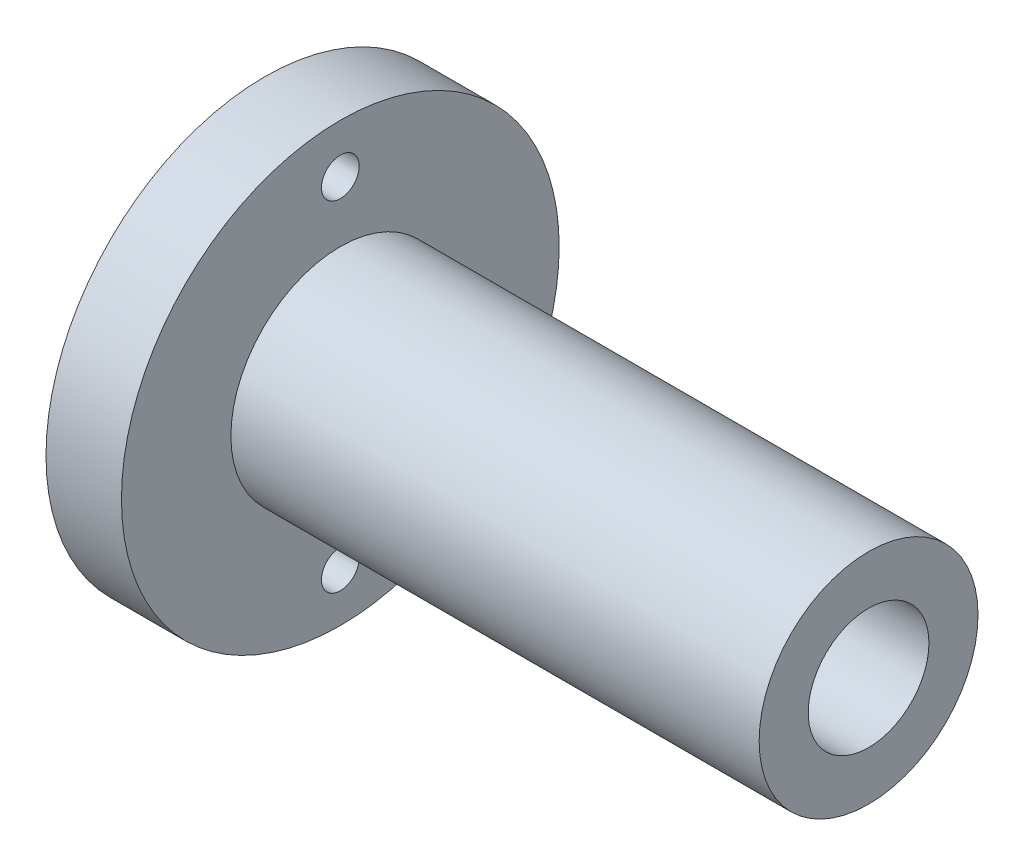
ISO-10303-21;
HEADER;
FILE_DESCRIPTION(('STEP AP214'),'2;1');
FILE_NAME('part.step','',(''),(''),'','','');
FILE_SCHEMA(('AUTOMOTIVE_DESIGN { 1 0 10303 214 1 1 1 1 }'));
ENDSEC;
DATA;
#1=APPLICATION_CONTEXT('core data for automotive mechanical design processes');
#2=APPLICATION_PROTOCOL_DEFINITION('international standard','automotive_design',2000,#1);
#3=PRODUCT_CONTEXT('',#1,'mechanical');
#4=PRODUCT('Part','Part','',(#3));
#5=PRODUCT_RELATED_PRODUCT_CATEGORY('part','',(#4));
#6=PRODUCT_DEFINITION_FORMATION('','',#4);
#7=PRODUCT_DEFINITION_CONTEXT('part definition',#1,'design');
#8=PRODUCT_DEFINITION('design','',#6,#7);
#9=PRODUCT_DEFINITION_SHAPE('','',#8);
#10=(LENGTH_UNIT() NAMED_UNIT(*) SI_UNIT(.MILLI.,.METRE.));
#11=(NAMED_UNIT(*) PLANE_ANGLE_UNIT() SI_UNIT($,.RADIAN.));
#12=(NAMED_UNIT(*) SI_UNIT($,.STERADIAN.) SOLID_ANGLE_UNIT());
#13=UNCERTAINTY_MEASURE_WITH_UNIT(LENGTH_MEASURE(1.E-05),#10,'distance_accuracy_value','');
#14=(GEOMETRIC_REPRESENTATION_CONTEXT(3) GLOBAL_UNCERTAINTY_ASSIGNED_CONTEXT((#13)) GLOBAL_UNIT_ASSIGNED_CONTEXT((#10,
#11,#12)) REPRESENTATION_CONTEXT('',''));
#15=CARTESIAN_POINT('',(0.,0.,0.));
#16=DIRECTION('',(0.,0.,1.));
#17=DIRECTION('',(1.,0.,0.));
#18=AXIS2_PLACEMENT_3D('',#15,#16,#17);
#19=CARTESIAN_POINT('',(70.,0.,0.));
#20=DIRECTION('',(-1.,0.,0.));
#21=DIRECTION('',(0.,0.,1.));
#22=AXIS2_PLACEMENT_3D('',#19,#20,#21);
#23=CYLINDRICAL_SURFACE('',#22,14.5);
#24=CARTESIAN_POINT('',(70.,0.,0.));
#25=DIRECTION('',(1.,0.,0.));
#26=DIRECTION('',(0.,0.,-1.));
#27=AXIS2_PLACEMENT_3D('',#24,#25,#26);
#28=CIRCLE('',#27,14.5);
#29=CARTESIAN_POINT('',(70.,0.,-14.5));
#30=VERTEX_POINT('',#29);
#31=EDGE_CURVE('E63',#30,#30,#28,.T.);
#32=ORIENTED_EDGE('',*,*,#31,.F.);
#33=EDGE_LOOP('',(#32));
#34=FACE_BOUND('',#33,.T.);
#35=CARTESIAN_POINT('',(0.,0.,0.));
#36=DIRECTION('',(1.,0.,0.));
#37=DIRECTION('',(0.,0.,-1.));
#38=AXIS2_PLACEMENT_3D('',#35,#36,#37);
#39=CIRCLE('',#38,14.5);
#40=CARTESIAN_POINT('',(0.,0.,-14.5));
#41=VERTEX_POINT('',#40);
#42=EDGE_CURVE('E69',#41,#41,#39,.T.);
#43=ORIENTED_EDGE('',*,*,#42,.T.);
#44=EDGE_LOOP('',(#43));
#45=FACE_BOUND('',#44,.T.);
#46=ADVANCED_FACE('F49',(#34,#45),#23,.T.);
#47=CARTESIAN_POINT('',(70.,0.,0.));
#48=DIRECTION('',(1.,0.,0.));
#49=DIRECTION('',(0.,0.,-1.));
#50=AXIS2_PLACEMENT_3D('',#47,#48,#49);
#51=PLANE('',#50);
#52=CARTESIAN_POINT('',(70.,0.,0.));
#53=DIRECTION('',(1.,0.,0.));
#54=DIRECTION('',(0.,0.,-1.));
#55=AXIS2_PLACEMENT_3D('',#52,#53,#54);
#56=CIRCLE('',#55,8.);
#57=CARTESIAN_POINT('',(70.,0.,-8.));
#58=VERTEX_POINT('',#57);
#59=EDGE_CURVE('E87',#58,#58,#56,.T.);
#60=ORIENTED_EDGE('',*,*,#59,.F.);
#61=EDGE_LOOP('',(#60));
#62=FACE_BOUND('',#61,.T.);
#63=ORIENTED_EDGE('',*,*,#31,.T.);
#64=EDGE_LOOP('',(#63));
#65=FACE_BOUND('',#64,.T.);
#66=ADVANCED_FACE('F128',(#62,#65),#51,.T.);
#67=CARTESIAN_POINT('',(-10.,0.,0.));
#68=DIRECTION('',(1.,0.,0.));
#69=DIRECTION('',(0.,0.,-1.));
#70=AXIS2_PLACEMENT_3D('',#67,#68,#69);
#71=CYLINDRICAL_SURFACE('',#70,29.);
#72=CARTESIAN_POINT('',(-10.,0.,0.));
#73=DIRECTION('',(-1.,0.,0.));
#74=DIRECTION('',(0.,0.,1.));
#75=AXIS2_PLACEMENT_3D('',#72,#73,#74);
#76=CIRCLE('',#75,29.);
#77=CARTESIAN_POINT('',(-10.,0.,29.));
#78=VERTEX_POINT('',#77);
#79=EDGE_CURVE('E74',#78,#78,#76,.T.);
#80=ORIENTED_EDGE('',*,*,#79,.F.);
#81=EDGE_LOOP('',(#80));
#82=FACE_BOUND('',#81,.T.);
#83=CARTESIAN_POINT('',(0.,0.,0.));
#84=DIRECTION('',(-1.,0.,0.));
#85=DIRECTION('',(0.,0.,1.));
#86=AXIS2_PLACEMENT_3D('',#83,#84,#85);
#87=CIRCLE('',#86,29.);
#88=CARTESIAN_POINT('',(0.,0.,29.));
#89=VERTEX_POINT('',#88);
#90=EDGE_CURVE('E76',#89,#89,#87,.T.);
#91=ORIENTED_EDGE('',*,*,#90,.T.);
#92=EDGE_LOOP('',(#91));
#93=FACE_BOUND('',#92,.T.);
#94=ADVANCED_FACE('F120',(#82,#93),#71,.T.);
#95=CARTESIAN_POINT('',(-10.,0.,0.));
#96=DIRECTION('',(-1.,0.,0.));
#97=DIRECTION('',(0.,0.,1.));
#98=AXIS2_PLACEMENT_3D('',#95,#96,#97);
#99=PLANE('',#98);
#100=CARTESIAN_POINT('',(-10.,22.5,0.));
#101=DIRECTION('',(-1.,0.,0.));
#102=DIRECTION('',(0.,0.,1.));
#103=AXIS2_PLACEMENT_3D('',#100,#101,#102);
#104=CIRCLE('',#103,2.5);
#105=CARTESIAN_POINT('',(-10.,22.5,2.5));
#106=VERTEX_POINT('',#105);
#107=EDGE_CURVE('E100',#106,#106,#104,.T.);
#108=ORIENTED_EDGE('',*,*,#107,.F.);
#109=EDGE_LOOP('',(#108));
#110=FACE_BOUND('',#109,.T.);
#111=CARTESIAN_POINT('',(-10.,-22.5,0.));
#112=DIRECTION('',(-1.,0.,0.));
#113=DIRECTION('',(0.,0.,1.));
#114=AXIS2_PLACEMENT_3D('',#111,#112,#113);
#115=CIRCLE('',#114,2.5);
#116=CARTESIAN_POINT('',(-10.,-22.5,2.5));
#117=VERTEX_POINT('',#116);
#118=EDGE_CURVE('E101',#117,#117,#115,.T.);
#119=ORIENTED_EDGE('',*,*,#118,.F.);
#120=EDGE_LOOP('',(#119));
#121=FACE_BOUND('',#120,.T.);
#122=CARTESIAN_POINT('',(-10.,0.,0.));
#123=DIRECTION('',(-1.,0.,0.));
#124=DIRECTION('',(0.,0.,1.));
#125=AXIS2_PLACEMENT_3D('',#122,#123,#124);
#126=CIRCLE('',#125,17.);
#127=CARTESIAN_POINT('',(-10.,0.,17.));
#128=VERTEX_POINT('',#127);
#129=EDGE_CURVE('E10',#128,#128,#126,.F.);
#130=ORIENTED_EDGE('',*,*,#129,.T.);
#131=EDGE_LOOP('',(#130));
#132=FACE_BOUND('',#131,.T.);
#133=ORIENTED_EDGE('',*,*,#79,.T.);
#134=EDGE_LOOP('',(#133));
#135=FACE_BOUND('',#134,.T.);
#136=ADVANCED_FACE('F116',(#110,#121,#132,#135),#99,.T.);
#137=CARTESIAN_POINT('',(0.,0.,0.));
#138=DIRECTION('',(-1.,0.,0.));
#139=DIRECTION('',(0.,0.,1.));
#140=AXIS2_PLACEMENT_3D('',#137,#138,#139);
#141=PLANE('',#140);
#142=CARTESIAN_POINT('',(0.,22.5,0.));
#143=DIRECTION('',(-1.,0.,0.));
#144=DIRECTION('',(0.,0.,1.));
#145=AXIS2_PLACEMENT_3D('',#142,#143,#144);
#146=CIRCLE('',#145,2.5);
#147=CARTESIAN_POINT('',(0.,22.5,2.5));
#148=VERTEX_POINT('',#147);
#149=EDGE_CURVE('E92',#148,#148,#146,.F.);
#150=ORIENTED_EDGE('',*,*,#149,.F.);
#151=EDGE_LOOP('',(#150));
#152=FACE_BOUND('',#151,.T.);
#153=CARTESIAN_POINT('',(0.,-22.5,0.));
#154=DIRECTION('',(-1.,0.,0.));
#155=DIRECTION('',(0.,0.,1.));
#156=AXIS2_PLACEMENT_3D('',#153,#154,#155);
#157=CIRCLE('',#156,2.5);
#158=CARTESIAN_POINT('',(0.,-22.5,2.5));
#159=VERTEX_POINT('',#158);
#160=EDGE_CURVE('E96',#159,#159,#157,.F.);
#161=ORIENTED_EDGE('',*,*,#160,.F.);
#162=EDGE_LOOP('',(#161));
#163=FACE_BOUND('',#162,.T.);
#164=ORIENTED_EDGE('',*,*,#42,.F.);
#165=EDGE_LOOP('',(#164));
#166=FACE_BOUND('',#165,.T.);
#167=ORIENTED_EDGE('',*,*,#90,.F.);
#168=EDGE_LOOP('',(#167));
#169=FACE_BOUND('',#168,.T.);
#170=ADVANCED_FACE('F119',(#152,#163,#166,#169),#141,.F.);
#171=CARTESIAN_POINT('',(38.,0.,0.));
#172=DIRECTION('',(-1.,0.,0.));
#173=DIRECTION('',(0.,0.,1.));
#174=AXIS2_PLACEMENT_3D('',#171,#172,#173);
#175=CYLINDRICAL_SURFACE('',#174,13.);
#176=CARTESIAN_POINT('',(-6.00000000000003,0.,0.));
#177=DIRECTION('',(-1.,0.,0.));
#178=DIRECTION('',(0.,0.,1.));
#179=AXIS2_PLACEMENT_3D('',#176,#177,#178);
#180=CIRCLE('',#179,13.);
#181=CARTESIAN_POINT('',(-6.00000000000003,0.,13.));
#182=VERTEX_POINT('',#181);
#183=EDGE_CURVE('E57',#182,#182,#180,.T.);
#184=ORIENTED_EDGE('',*,*,#183,.T.);
#185=EDGE_LOOP('',(#184));
#186=FACE_BOUND('',#185,.T.);
#187=CARTESIAN_POINT('',(38.,0.,0.));
#188=DIRECTION('',(-1.,0.,0.));
#189=DIRECTION('',(0.,0.,1.));
#190=AXIS2_PLACEMENT_3D('',#187,#188,#189);
#191=CIRCLE('',#190,13.);
#192=CARTESIAN_POINT('',(38.,0.,13.));
#193=VERTEX_POINT('',#192);
#194=EDGE_CURVE('E80',#193,#193,#191,.T.);
#195=ORIENTED_EDGE('',*,*,#194,.F.);
#196=EDGE_LOOP('',(#195));
#197=FACE_BOUND('',#196,.T.);
#198=ADVANCED_FACE('F133',(#186,#197),#175,.F.);
#199=CARTESIAN_POINT('',(38.,0.,0.));
#200=DIRECTION('',(-1.,0.,0.));
#201=DIRECTION('',(0.,0.,1.));
#202=AXIS2_PLACEMENT_3D('',#199,#200,#201);
#203=PLANE('',#202);
#204=CARTESIAN_POINT('',(38.,0.,0.));
#205=DIRECTION('',(-1.,0.,0.));
#206=DIRECTION('',(0.,0.,1.));
#207=AXIS2_PLACEMENT_3D('',#204,#205,#206);
#208=CIRCLE('',#207,8.);
#209=CARTESIAN_POINT('',(38.,0.,8.));
#210=VERTEX_POINT('',#209);
#211=EDGE_CURVE('E88',#210,#210,#208,.F.);
#212=ORIENTED_EDGE('',*,*,#211,.T.);
#213=EDGE_LOOP('',(#212));
#214=FACE_BOUND('',#213,.T.);
#215=ORIENTED_EDGE('',*,*,#194,.T.);
#216=EDGE_LOOP('',(#215));
#217=FACE_BOUND('',#216,.T.);
#218=ADVANCED_FACE('F139',(#214,#217),#203,.T.);
#219=CARTESIAN_POINT('',(-10.001,0.,0.));
#220=DIRECTION('',(1.,0.,0.));
#221=DIRECTION('',(0.,0.,-1.));
#222=AXIS2_PLACEMENT_3D('',#219,#220,#221);
#223=CYLINDRICAL_SURFACE('',#222,8.);
#224=ORIENTED_EDGE('',*,*,#211,.F.);
#225=EDGE_LOOP('',(#224));
#226=FACE_BOUND('',#225,.T.);
#227=ORIENTED_EDGE('',*,*,#59,.T.);
#228=EDGE_LOOP('',(#227));
#229=FACE_BOUND('',#228,.T.);
#230=ADVANCED_FACE('F159',(#226,#229),#223,.F.);
#231=CARTESIAN_POINT('',(-6.00000000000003,0.,0.));
#232=DIRECTION('',(-1.,0.,0.));
#233=DIRECTION('',(0.,0.,1.));
#234=AXIS2_PLACEMENT_3D('',#231,#232,#233);
#235=CONICAL_SURFACE('',#234,13.,0.785398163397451);
#236=ORIENTED_EDGE('',*,*,#129,.F.);
#237=EDGE_LOOP('',(#236));
#238=FACE_BOUND('',#237,.T.);
#239=ORIENTED_EDGE('',*,*,#183,.F.);
#240=EDGE_LOOP('',(#239));
#241=FACE_BOUND('',#240,.T.);
#242=ADVANCED_FACE('F51',(#238,#241),#235,.F.);
#243=CARTESIAN_POINT('',(70.001,-22.5,0.));
#244=DIRECTION('',(-1.,0.,0.));
#245=DIRECTION('',(0.,0.,1.));
#246=AXIS2_PLACEMENT_3D('',#243,#244,#245);
#247=CYLINDRICAL_SURFACE('',#246,2.5);
#248=ORIENTED_EDGE('',*,*,#118,.T.);
#249=EDGE_LOOP('',(#248));
#250=FACE_BOUND('',#249,.T.);
#251=ORIENTED_EDGE('',*,*,#160,.T.);
#252=EDGE_LOOP('',(#251));
#253=FACE_BOUND('',#252,.T.);
#254=ADVANCED_FACE('F167',(#250,#253),#247,.F.);
#255=CARTESIAN_POINT('',(70.001,22.5,0.));
#256=DIRECTION('',(-1.,0.,0.));
#257=DIRECTION('',(0.,0.,1.));
#258=AXIS2_PLACEMENT_3D('',#255,#256,#257);
#259=CYLINDRICAL_SURFACE('',#258,2.5);
#260=ORIENTED_EDGE('',*,*,#107,.T.);
#261=EDGE_LOOP('',(#260));
#262=FACE_BOUND('',#261,.T.);
#263=ORIENTED_EDGE('',*,*,#149,.T.);
#264=EDGE_LOOP('',(#263));
#265=FACE_BOUND('',#264,.T.);
#266=ADVANCED_FACE('F113',(#262,#265),#259,.F.);
#267=CLOSED_SHELL('',(#46,#66,#94,#136,#170,#198,#218,#230,#242,#254,#266));
#268=MANIFOLD_SOLID_BREP('B2',#267);
#269=ADVANCED_BREP_SHAPE_REPRESENTATION('',(#18,#268),#14);
#270=SHAPE_DEFINITION_REPRESENTATION(#9,#269);
ENDSEC;
END-ISO-10303-21;
